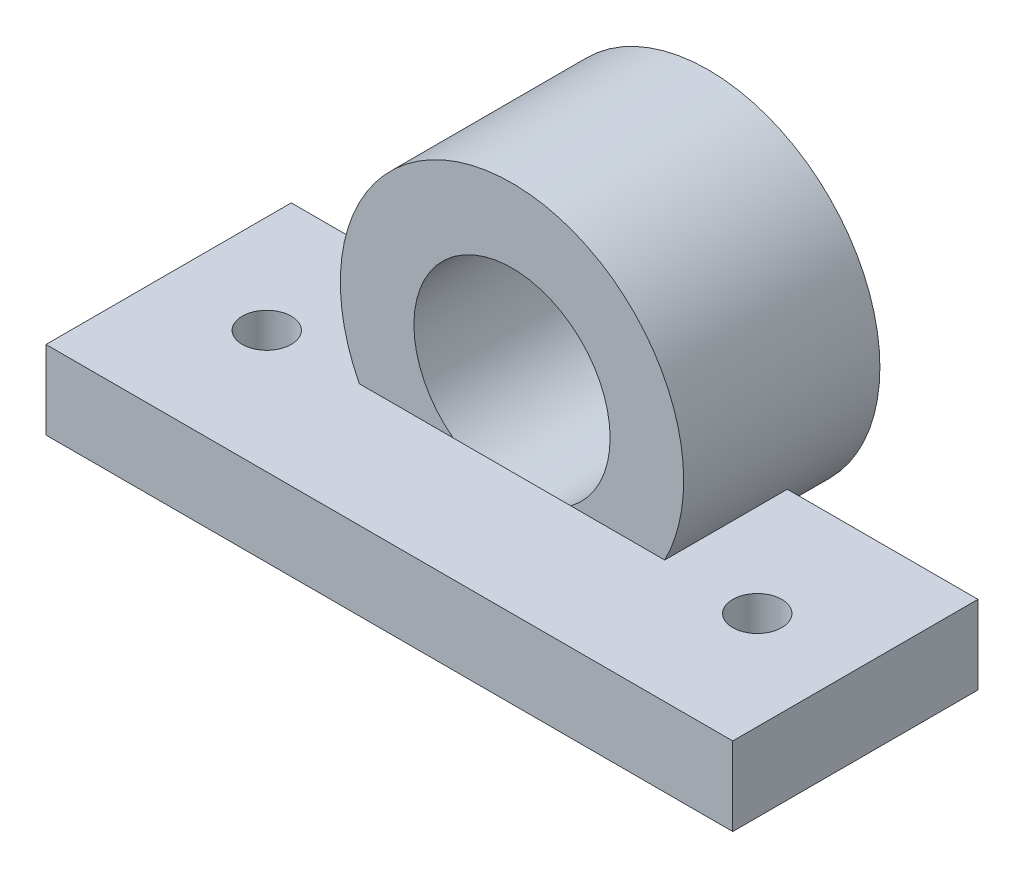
from build123d import *

# Parameters (mm, degrees)
SKETCH_1_W          = 140
SKETCH_1_H          = 50
EXTRUDE_1_DEPTH     = 16
SKETCH_2_R          = 35
EXTRUDE_2_DEPTH     = 40
SKETCH_3_R          = 20
CUT_EXTRUDE_1_DEPTH = 40
SKETCH_4_R          = 5
CUT_EXTRUDE_2_DEPTH = 16


with BuildPart() as part:
    # Sketch 1 → Extrude 1 (new body)
    with BuildSketch(Plane(origin=(0, 0, 0), x_dir=(1, 0, 0), z_dir=(0, 1, 0))):
        Rectangle(SKETCH_1_W, SKETCH_1_H)
    extrude(amount=-EXTRUDE_1_DEPTH)

    # Sketch 2 → Extrude 2 (add)
    with BuildSketch(Plane.XY):
        with Locations((0, 16)):
            Circle(SKETCH_2_R)
    extrude(amount=-EXTRUDE_2_DEPTH)

    # Sketch 3 → Cut-Extrude 1 (cut)
    with BuildSketch(Plane.XY):
        with Locations((0, 16)):
            Circle(SKETCH_3_R)
    extrude(amount=-CUT_EXTRUDE_1_DEPTH, mode=Mode.SUBTRACT)

    # Sketch 4 → Cut-Extrude 2 (cut)
    with BuildSketch(Plane(origin=(0, 0, 0), x_dir=(1, 0, 0), z_dir=(0, 1, 0))):
        with Locations(Location((-50, 0, 0), (0, 0, 270))):
            Circle(SKETCH_4_R)
        with Locations(Location((50, 0, 0), (0, 0, 270))):
            Circle(SKETCH_4_R)
    extrude(amount=-CUT_EXTRUDE_2_DEPTH, mode=Mode.SUBTRACT)


solid = part.part
